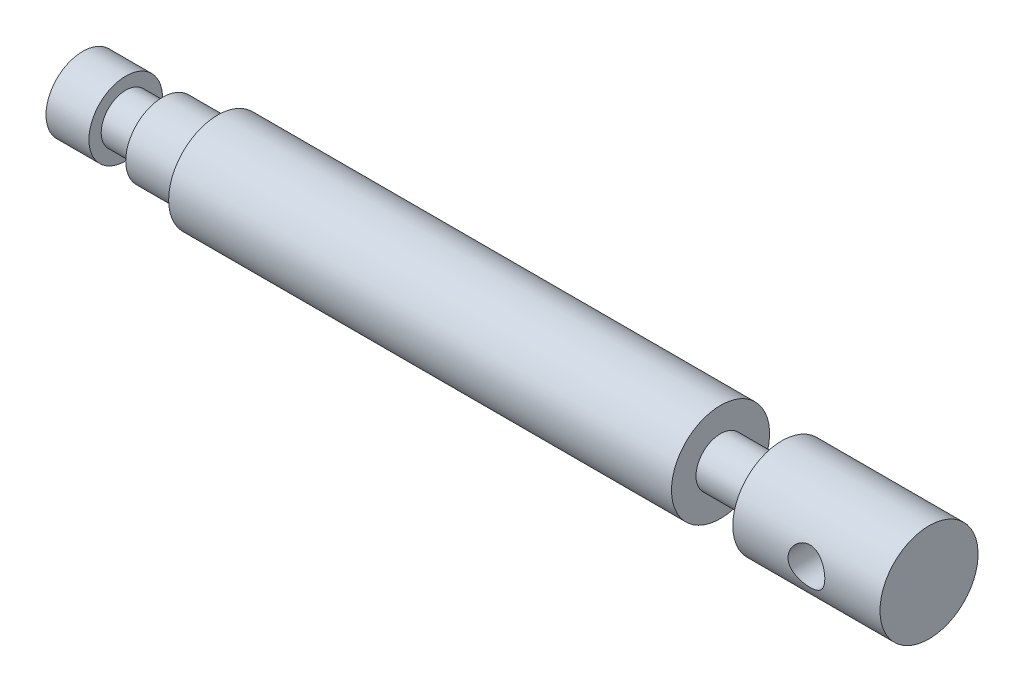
ISO-10303-21;
HEADER;
FILE_DESCRIPTION(('STEP AP214'),'2;1');
FILE_NAME('part.step','',(''),(''),'','','');
FILE_SCHEMA(('AUTOMOTIVE_DESIGN { 1 0 10303 214 1 1 1 1 }'));
ENDSEC;
DATA;
#1=APPLICATION_CONTEXT('core data for automotive mechanical design processes');
#2=APPLICATION_PROTOCOL_DEFINITION('international standard','automotive_design',2000,#1);
#3=PRODUCT_CONTEXT('',#1,'mechanical');
#4=PRODUCT('Part','Part','',(#3));
#5=PRODUCT_RELATED_PRODUCT_CATEGORY('part','',(#4));
#6=PRODUCT_DEFINITION_FORMATION('','',#4);
#7=PRODUCT_DEFINITION_CONTEXT('part definition',#1,'design');
#8=PRODUCT_DEFINITION('design','',#6,#7);
#9=PRODUCT_DEFINITION_SHAPE('','',#8);
#10=(LENGTH_UNIT() NAMED_UNIT(*) SI_UNIT(.MILLI.,.METRE.));
#11=(NAMED_UNIT(*) PLANE_ANGLE_UNIT() SI_UNIT($,.RADIAN.));
#12=(NAMED_UNIT(*) SI_UNIT($,.STERADIAN.) SOLID_ANGLE_UNIT());
#13=UNCERTAINTY_MEASURE_WITH_UNIT(LENGTH_MEASURE(1.E-05),#10,'distance_accuracy_value','');
#14=(GEOMETRIC_REPRESENTATION_CONTEXT(3) GLOBAL_UNCERTAINTY_ASSIGNED_CONTEXT((#13)) GLOBAL_UNIT_ASSIGNED_CONTEXT((#10,
#11,#12)) REPRESENTATION_CONTEXT('',''));
#15=CARTESIAN_POINT('',(0.,0.,0.));
#16=DIRECTION('',(0.,0.,1.));
#17=DIRECTION('',(1.,0.,0.));
#18=AXIS2_PLACEMENT_3D('',#15,#16,#17);
#19=CARTESIAN_POINT('',(0.,0.,0.));
#20=DIRECTION('',(1.,0.,0.));
#21=DIRECTION('',(0.,0.,-1.));
#22=AXIS2_PLACEMENT_3D('',#19,#20,#21);
#23=PLANE('',#22);
#24=CARTESIAN_POINT('',(0.,0.,0.));
#25=DIRECTION('',(-1.,0.,0.));
#26=DIRECTION('',(0.,0.,1.));
#27=AXIS2_PLACEMENT_3D('',#24,#25,#26);
#28=CIRCLE('',#27,6.);
#29=CARTESIAN_POINT('',(0.,0.,6.));
#30=VERTEX_POINT('',#29);
#31=EDGE_CURVE('E10',#30,#30,#28,.T.);
#32=ORIENTED_EDGE('',*,*,#31,.T.);
#33=EDGE_LOOP('',(#32));
#34=FACE_BOUND('',#33,.T.);
#35=ADVANCED_FACE('F29',(#34),#23,.F.);
#36=CARTESIAN_POINT('',(0.,0.,0.));
#37=DIRECTION('',(-1.,0.,0.));
#38=DIRECTION('',(0.,0.,1.));
#39=AXIS2_PLACEMENT_3D('',#36,#37,#38);
#40=CYLINDRICAL_SURFACE('',#39,6.);
#41=ORIENTED_EDGE('',*,*,#31,.F.);
#42=EDGE_LOOP('',(#41));
#43=FACE_BOUND('',#42,.T.);
#44=CARTESIAN_POINT('',(7.,0.,0.));
#45=DIRECTION('',(-1.,0.,0.));
#46=DIRECTION('',(0.,0.,1.));
#47=AXIS2_PLACEMENT_3D('',#44,#45,#46);
#48=CIRCLE('',#47,6.);
#49=CARTESIAN_POINT('',(7.,0.,6.));
#50=VERTEX_POINT('',#49);
#51=EDGE_CURVE('E40',#50,#50,#48,.T.);
#52=ORIENTED_EDGE('',*,*,#51,.T.);
#53=EDGE_LOOP('',(#52));
#54=FACE_BOUND('',#53,.T.);
#55=ADVANCED_FACE('F71',(#43,#54),#40,.T.);
#56=CARTESIAN_POINT('',(7.,6.,0.));
#57=DIRECTION('',(-1.,0.,0.));
#58=DIRECTION('',(0.,0.,1.));
#59=AXIS2_PLACEMENT_3D('',#56,#57,#58);
#60=PLANE('',#59);
#61=ORIENTED_EDGE('',*,*,#51,.F.);
#62=EDGE_LOOP('',(#61));
#63=FACE_BOUND('',#62,.T.);
#64=CARTESIAN_POINT('',(7.,0.,0.));
#65=DIRECTION('',(-1.,0.,0.));
#66=DIRECTION('',(0.,0.,1.));
#67=AXIS2_PLACEMENT_3D('',#64,#65,#66);
#68=CIRCLE('',#67,4.);
#69=CARTESIAN_POINT('',(7.,0.,4.));
#70=VERTEX_POINT('',#69);
#71=EDGE_CURVE('E45',#70,#70,#68,.T.);
#72=ORIENTED_EDGE('',*,*,#71,.T.);
#73=EDGE_LOOP('',(#72));
#74=FACE_BOUND('',#73,.T.);
#75=ADVANCED_FACE('F75',(#63,#74),#60,.F.);
#76=CARTESIAN_POINT('',(0.,0.,0.));
#77=DIRECTION('',(-1.,0.,0.));
#78=DIRECTION('',(0.,0.,1.));
#79=AXIS2_PLACEMENT_3D('',#76,#77,#78);
#80=CYLINDRICAL_SURFACE('',#79,4.);
#81=ORIENTED_EDGE('',*,*,#71,.F.);
#82=EDGE_LOOP('',(#81));
#83=FACE_BOUND('',#82,.T.);
#84=CARTESIAN_POINT('',(13.,0.,0.));
#85=DIRECTION('',(-1.,0.,0.));
#86=DIRECTION('',(0.,0.,1.));
#87=AXIS2_PLACEMENT_3D('',#84,#85,#86);
#88=CIRCLE('',#87,4.);
#89=CARTESIAN_POINT('',(13.,0.,4.));
#90=VERTEX_POINT('',#89);
#91=EDGE_CURVE('E144',#90,#90,#88,.T.);
#92=ORIENTED_EDGE('',*,*,#91,.T.);
#93=EDGE_LOOP('',(#92));
#94=FACE_BOUND('',#93,.T.);
#95=ADVANCED_FACE('F80',(#83,#94),#80,.T.);
#96=CARTESIAN_POINT('',(13.,4.,0.));
#97=DIRECTION('',(1.,0.,0.));
#98=DIRECTION('',(0.,0.,-1.));
#99=AXIS2_PLACEMENT_3D('',#96,#97,#98);
#100=PLANE('',#99);
#101=ORIENTED_EDGE('',*,*,#91,.F.);
#102=EDGE_LOOP('',(#101));
#103=FACE_BOUND('',#102,.T.);
#104=CARTESIAN_POINT('',(13.,0.,0.));
#105=DIRECTION('',(-1.,0.,0.));
#106=DIRECTION('',(0.,0.,1.));
#107=AXIS2_PLACEMENT_3D('',#104,#105,#106);
#108=CIRCLE('',#107,6.);
#109=CARTESIAN_POINT('',(13.,0.,6.));
#110=VERTEX_POINT('',#109);
#111=EDGE_CURVE('E141',#110,#110,#108,.T.);
#112=ORIENTED_EDGE('',*,*,#111,.T.);
#113=EDGE_LOOP('',(#112));
#114=FACE_BOUND('',#113,.T.);
#115=ADVANCED_FACE('F87',(#103,#114),#100,.F.);
#116=CARTESIAN_POINT('',(0.,0.,0.));
#117=DIRECTION('',(-1.,0.,0.));
#118=DIRECTION('',(0.,0.,1.));
#119=AXIS2_PLACEMENT_3D('',#116,#117,#118);
#120=CYLINDRICAL_SURFACE('',#119,6.);
#121=ORIENTED_EDGE('',*,*,#111,.F.);
#122=EDGE_LOOP('',(#121));
#123=FACE_BOUND('',#122,.T.);
#124=CARTESIAN_POINT('',(22.,0.,0.));
#125=DIRECTION('',(-1.,0.,0.));
#126=DIRECTION('',(0.,0.,1.));
#127=AXIS2_PLACEMENT_3D('',#124,#125,#126);
#128=CIRCLE('',#127,6.);
#129=CARTESIAN_POINT('',(22.,0.,6.));
#130=VERTEX_POINT('',#129);
#131=EDGE_CURVE('E138',#130,#130,#128,.T.);
#132=ORIENTED_EDGE('',*,*,#131,.T.);
#133=EDGE_LOOP('',(#132));
#134=FACE_BOUND('',#133,.T.);
#135=ADVANCED_FACE('F91',(#123,#134),#120,.T.);
#136=CARTESIAN_POINT('',(22.,6.,0.));
#137=DIRECTION('',(1.,0.,0.));
#138=DIRECTION('',(0.,0.,-1.));
#139=AXIS2_PLACEMENT_3D('',#136,#137,#138);
#140=PLANE('',#139);
#141=ORIENTED_EDGE('',*,*,#131,.F.);
#142=EDGE_LOOP('',(#141));
#143=FACE_BOUND('',#142,.T.);
#144=CARTESIAN_POINT('',(22.,0.,0.));
#145=DIRECTION('',(-1.,0.,0.));
#146=DIRECTION('',(0.,0.,1.));
#147=AXIS2_PLACEMENT_3D('',#144,#145,#146);
#148=CIRCLE('',#147,8.);
#149=CARTESIAN_POINT('',(22.,0.,8.));
#150=VERTEX_POINT('',#149);
#151=EDGE_CURVE('E135',#150,#150,#148,.T.);
#152=ORIENTED_EDGE('',*,*,#151,.T.);
#153=EDGE_LOOP('',(#152));
#154=FACE_BOUND('',#153,.T.);
#155=ADVANCED_FACE('F95',(#143,#154),#140,.F.);
#156=CARTESIAN_POINT('',(0.,0.,0.));
#157=DIRECTION('',(-1.,0.,0.));
#158=DIRECTION('',(0.,0.,1.));
#159=AXIS2_PLACEMENT_3D('',#156,#157,#158);
#160=CYLINDRICAL_SURFACE('',#159,8.);
#161=ORIENTED_EDGE('',*,*,#151,.F.);
#162=EDGE_LOOP('',(#161));
#163=FACE_BOUND('',#162,.T.);
#164=CARTESIAN_POINT('',(104.,0.,0.));
#165=DIRECTION('',(-1.,0.,0.));
#166=DIRECTION('',(0.,0.,1.));
#167=AXIS2_PLACEMENT_3D('',#164,#165,#166);
#168=CIRCLE('',#167,8.);
#169=CARTESIAN_POINT('',(104.,0.,8.));
#170=VERTEX_POINT('',#169);
#171=EDGE_CURVE('E132',#170,#170,#168,.T.);
#172=ORIENTED_EDGE('',*,*,#171,.T.);
#173=EDGE_LOOP('',(#172));
#174=FACE_BOUND('',#173,.T.);
#175=ADVANCED_FACE('F99',(#163,#174),#160,.T.);
#176=CARTESIAN_POINT('',(104.,8.,0.));
#177=DIRECTION('',(-1.,0.,0.));
#178=DIRECTION('',(0.,0.,1.));
#179=AXIS2_PLACEMENT_3D('',#176,#177,#178);
#180=PLANE('',#179);
#181=ORIENTED_EDGE('',*,*,#171,.F.);
#182=EDGE_LOOP('',(#181));
#183=FACE_BOUND('',#182,.T.);
#184=CARTESIAN_POINT('',(104.,0.,0.));
#185=DIRECTION('',(-1.,0.,0.));
#186=DIRECTION('',(0.,0.,1.));
#187=AXIS2_PLACEMENT_3D('',#184,#185,#186);
#188=CIRCLE('',#187,4.);
#189=CARTESIAN_POINT('',(104.,0.,4.));
#190=VERTEX_POINT('',#189);
#191=EDGE_CURVE('E125',#190,#190,#188,.T.);
#192=ORIENTED_EDGE('',*,*,#191,.T.);
#193=EDGE_LOOP('',(#192));
#194=FACE_BOUND('',#193,.T.);
#195=ADVANCED_FACE('F103',(#183,#194),#180,.F.);
#196=CARTESIAN_POINT('',(0.,0.,0.));
#197=DIRECTION('',(-1.,0.,0.));
#198=DIRECTION('',(0.,0.,1.));
#199=AXIS2_PLACEMENT_3D('',#196,#197,#198);
#200=CYLINDRICAL_SURFACE('',#199,4.);
#201=ORIENTED_EDGE('',*,*,#191,.F.);
#202=EDGE_LOOP('',(#201));
#203=FACE_BOUND('',#202,.T.);
#204=CARTESIAN_POINT('',(114.,0.,0.));
#205=DIRECTION('',(-1.,0.,0.));
#206=DIRECTION('',(0.,0.,1.));
#207=AXIS2_PLACEMENT_3D('',#204,#205,#206);
#208=CIRCLE('',#207,4.);
#209=CARTESIAN_POINT('',(114.,0.,4.));
#210=VERTEX_POINT('',#209);
#211=EDGE_CURVE('E118',#210,#210,#208,.T.);
#212=ORIENTED_EDGE('',*,*,#211,.T.);
#213=EDGE_LOOP('',(#212));
#214=FACE_BOUND('',#213,.T.);
#215=ADVANCED_FACE('F107',(#203,#214),#200,.T.);
#216=CARTESIAN_POINT('',(114.,4.,0.));
#217=DIRECTION('',(1.,0.,0.));
#218=DIRECTION('',(0.,0.,-1.));
#219=AXIS2_PLACEMENT_3D('',#216,#217,#218);
#220=PLANE('',#219);
#221=ORIENTED_EDGE('',*,*,#211,.F.);
#222=EDGE_LOOP('',(#221));
#223=FACE_BOUND('',#222,.T.);
#224=CARTESIAN_POINT('',(114.,0.,0.));
#225=DIRECTION('',(-1.,0.,0.));
#226=DIRECTION('',(0.,0.,1.));
#227=AXIS2_PLACEMENT_3D('',#224,#225,#226);
#228=CIRCLE('',#227,8.);
#229=CARTESIAN_POINT('',(114.,0.,8.));
#230=VERTEX_POINT('',#229);
#231=EDGE_CURVE('E121',#230,#230,#228,.T.);
#232=ORIENTED_EDGE('',*,*,#231,.T.);
#233=EDGE_LOOP('',(#232));
#234=FACE_BOUND('',#233,.T.);
#235=ADVANCED_FACE('F67',(#223,#234),#220,.F.);
#236=CARTESIAN_POINT('',(0.,0.,0.));
#237=DIRECTION('',(-1.,0.,0.));
#238=DIRECTION('',(0.,0.,1.));
#239=AXIS2_PLACEMENT_3D('',#236,#237,#238);
#240=CYLINDRICAL_SURFACE('',#239,8.);
#241=CARTESIAN_POINT('',(129.,0.,8.));
#242=CARTESIAN_POINT('',(129.000005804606,-0.162470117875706,8.00000434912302));
#243=CARTESIAN_POINT('',(128.986760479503,-0.324900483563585,7.99500758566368));
#244=CARTESIAN_POINT('',(128.93434360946,-0.644906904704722,7.97557392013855));
#245=CARTESIAN_POINT('',(128.895175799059,-0.80248365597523,7.96113837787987));
#246=CARTESIAN_POINT('',(128.792493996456,-1.10812156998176,7.92437664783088));
#247=CARTESIAN_POINT('',(128.729026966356,-1.25620044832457,7.90206568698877));
#248=CARTESIAN_POINT('',(128.579787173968,-1.53959862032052,7.85177535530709));
#249=CARTESIAN_POINT('',(128.494008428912,-1.67491447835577,7.82379446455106));
#250=CARTESIAN_POINT('',(128.298774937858,-1.93469283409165,7.76372493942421));
#251=CARTESIAN_POINT('',(128.188539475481,-2.05854146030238,7.73152005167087));
#252=CARTESIAN_POINT('',(127.949179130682,-2.28648842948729,7.66720441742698));
#253=CARTESIAN_POINT('',(127.820048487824,-2.39058072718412,7.63509370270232));
#254=CARTESIAN_POINT('',(127.540565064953,-2.57996404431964,7.5732494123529));
#255=CARTESIAN_POINT('',(127.389591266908,-2.66438786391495,7.5436529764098));
#256=CARTESIAN_POINT('',(127.074303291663,-2.80637292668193,7.49199720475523));
#257=CARTESIAN_POINT('',(126.909994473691,-2.86394489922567,7.46993485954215));
#258=CARTESIAN_POINT('',(126.579766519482,-2.94816862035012,7.4370882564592));
#259=CARTESIAN_POINT('',(126.414189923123,-2.97599186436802,7.42587848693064));
#260=CARTESIAN_POINT('',(126.080367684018,-3.00359113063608,7.41476122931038));
#261=CARTESIAN_POINT('',(125.912123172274,-3.00337873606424,7.41484907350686));
#262=CARTESIAN_POINT('',(125.588460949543,-2.97580859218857,7.42595023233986));
#263=CARTESIAN_POINT('',(125.432878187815,-2.9500761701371,7.43630937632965));
#264=CARTESIAN_POINT('',(125.128425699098,-2.87488335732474,7.46569876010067));
#265=CARTESIAN_POINT('',(124.979556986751,-2.82541939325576,7.48473030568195));
#266=CARTESIAN_POINT('',(124.689445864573,-2.70327497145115,7.52971404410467));
#267=CARTESIAN_POINT('',(124.548401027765,-2.63017297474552,7.55579035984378));
#268=CARTESIAN_POINT('',(124.28010852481,-2.46312147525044,7.61188420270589));
#269=CARTESIAN_POINT('',(124.152865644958,-2.36916477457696,7.64190308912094));
#270=CARTESIAN_POINT('',(123.906792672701,-2.15563561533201,7.70496077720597));
#271=CARTESIAN_POINT('',(123.789102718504,-2.03476597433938,7.73806694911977));
#272=CARTESIAN_POINT('',(123.575324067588,-1.77462518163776,7.80183456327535));
#273=CARTESIAN_POINT('',(123.479238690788,-1.63535120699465,7.83249562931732));
#274=CARTESIAN_POINT('',(123.310139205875,-1.33944687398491,7.88852789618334));
#275=CARTESIAN_POINT('',(123.237504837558,-1.18258142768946,7.91380996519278));
#276=CARTESIAN_POINT('',(123.12003479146,-0.857673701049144,7.95557436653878));
#277=CARTESIAN_POINT('',(123.075186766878,-0.689636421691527,7.97206060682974));
#278=CARTESIAN_POINT('',(123.016754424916,-0.356750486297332,7.99368886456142));
#279=CARTESIAN_POINT('',(123.001634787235,-0.192207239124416,7.99938738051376));
#280=CARTESIAN_POINT('',(122.9986178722,0.137144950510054,8.00051787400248));
#281=CARTESIAN_POINT('',(123.010714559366,0.301953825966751,7.99595212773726));
#282=CARTESIAN_POINT('',(123.060620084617,0.620524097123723,7.97743419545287));
#283=CARTESIAN_POINT('',(123.097423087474,0.774466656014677,7.9638494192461));
#284=CARTESIAN_POINT('',(123.194372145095,1.07388350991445,7.92902954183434));
#285=CARTESIAN_POINT('',(123.254521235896,1.21935670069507,7.9077934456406));
#286=CARTESIAN_POINT('',(123.398372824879,1.50249553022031,7.85899248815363));
#287=CARTESIAN_POINT('',(123.482715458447,1.63980616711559,7.83126000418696));
#288=CARTESIAN_POINT('',(123.671836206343,1.89878542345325,7.77253343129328));
#289=CARTESIAN_POINT('',(123.77662186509,2.0204482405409,7.74153814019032));
#290=CARTESIAN_POINT('',(124.010808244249,2.25206159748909,7.67746658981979));
#291=CARTESIAN_POINT('',(124.141284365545,2.36092308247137,7.64437393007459));
#292=CARTESIAN_POINT('',(124.419302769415,2.55542100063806,7.58157631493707));
#293=CARTESIAN_POINT('',(124.566846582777,2.64105534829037,7.55187166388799));
#294=CARTESIAN_POINT('',(124.876031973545,2.78675547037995,7.49933659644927));
#295=CARTESIAN_POINT('',(125.037729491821,2.84671370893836,7.47653520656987));
#296=CARTESIAN_POINT('',(125.370019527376,2.93815766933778,7.4410806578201));
#297=CARTESIAN_POINT('',(125.540606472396,2.9696610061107,7.42842122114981));
#298=CARTESIAN_POINT('',(125.874032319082,3.00172694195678,7.41551789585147));
#299=CARTESIAN_POINT('',(126.036665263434,3.00414662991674,7.41452889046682));
#300=CARTESIAN_POINT('',(126.359890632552,2.98273431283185,7.42316825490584));
#301=CARTESIAN_POINT('',(126.520483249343,2.95890479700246,7.43279561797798));
#302=CARTESIAN_POINT('',(126.830094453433,2.88711631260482,7.46096283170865));
#303=CARTESIAN_POINT('',(126.979316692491,2.83991596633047,7.47922170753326));
#304=CARTESIAN_POINT('',(127.267811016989,2.72339393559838,7.5224309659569));
#305=CARTESIAN_POINT('',(127.40708057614,2.65406665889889,7.54738303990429));
#306=CARTESIAN_POINT('',(127.679653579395,2.49104151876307,7.60279447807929));
#307=CARTESIAN_POINT('',(127.8122615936,2.3962566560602,7.63347396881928));
#308=CARTESIAN_POINT('',(128.060283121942,2.18668971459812,7.69612493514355));
#309=CARTESIAN_POINT('',(128.175691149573,2.07190128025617,7.7280968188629));
#310=CARTESIAN_POINT('',(128.392403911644,1.81816079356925,7.79180849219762));
#311=CARTESIAN_POINT('',(128.492607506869,1.67823728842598,7.82344209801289));
#312=CARTESIAN_POINT('',(128.668045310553,1.38242644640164,7.88109028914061));
#313=CARTESIAN_POINT('',(128.743277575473,1.22653786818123,7.90710443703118));
#314=CARTESIAN_POINT('',(128.868753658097,0.895998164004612,7.9514858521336));
#315=CARTESIAN_POINT('',(128.917774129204,0.720826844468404,7.96947314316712));
#316=CARTESIAN_POINT('',(128.983385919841,0.363751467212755,7.99372484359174));
#317=CARTESIAN_POINT('',(128.999993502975,0.181850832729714,7.99999513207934));
#318=CARTESIAN_POINT('',(129.,0.,8.));
#319=B_SPLINE_CURVE_WITH_KNOTS('',3,(#241,#242,#243,#244,#245,#246,#247,#248,#249,#250,#251,
#252,#253,#254,#255,#256,#257,#258,#259,#260,#261,#262,#263,#264,#265,#266,#267,#268,#269,#270,
#271,#272,#273,#274,#275,#276,#277,#278,#279,#280,#281,#282,#283,#284,#285,#286,#287,#288,#289,
#290,#291,#292,#293,#294,#295,#296,#297,#298,#299,#300,#301,#302,#303,#304,#305,#306,#307,#308,
#309,#310,#311,#312,#313,#314,#315,#316,#317,#318),.UNSPECIFIED.,.T.,.F.,(4,2,2,2,2,2,2,2,2,2,2,
2,2,2,2,2,2,2,2,2,2,2,2,2,2,2,2,2,2,2,2,2,2,2,2,2,2,2,4),(0.,0.48673960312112,0.973409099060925,
1.45914273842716,1.94500675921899,2.44947237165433,2.95409209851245,3.47793349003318,
4.00156538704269,4.503717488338,5.00566212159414,5.47756690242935,5.9495427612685,
6.43044816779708,6.9115198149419,7.42492306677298,7.93840515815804,8.45982750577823,
8.98101799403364,9.47450039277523,9.96787336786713,10.4422887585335,10.9167658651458,
11.4051844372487,11.8937836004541,12.4107303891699,12.9277235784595,13.4468613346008,
13.9656774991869,14.4511752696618,14.9366270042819,15.4072628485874,15.8780177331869,
16.3734494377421,16.8690388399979,17.3914465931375,17.9138949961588,18.4589703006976,
19.0037720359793),.UNSPECIFIED.);
#320=CARTESIAN_POINT('',(129.,0.,8.));
#321=VERTEX_POINT('',#320);
#322=EDGE_CURVE('E32',#321,#321,#319,.T.);
#323=ORIENTED_EDGE('',*,*,#322,.T.);
#324=EDGE_LOOP('',(#323));
#325=FACE_BOUND('',#324,.T.);
#326=CARTESIAN_POINT('',(129.,0.,-8.));
#327=CARTESIAN_POINT('',(129.000005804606,0.162470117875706,-8.00000434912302));
#328=CARTESIAN_POINT('',(128.986760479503,0.324900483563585,-7.99500758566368));
#329=CARTESIAN_POINT('',(128.93434360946,0.644906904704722,-7.97557392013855));
#330=CARTESIAN_POINT('',(128.895175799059,0.80248365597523,-7.96113837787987));
#331=CARTESIAN_POINT('',(128.792493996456,1.10812156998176,-7.92437664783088));
#332=CARTESIAN_POINT('',(128.729026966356,1.25620044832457,-7.90206568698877));
#333=CARTESIAN_POINT('',(128.579787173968,1.53959862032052,-7.85177535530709));
#334=CARTESIAN_POINT('',(128.494008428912,1.67491447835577,-7.82379446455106));
#335=CARTESIAN_POINT('',(128.298774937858,1.93469283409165,-7.76372493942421));
#336=CARTESIAN_POINT('',(128.188539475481,2.05854146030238,-7.73152005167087));
#337=CARTESIAN_POINT('',(127.949179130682,2.28648842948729,-7.66720441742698));
#338=CARTESIAN_POINT('',(127.820048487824,2.39058072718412,-7.63509370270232));
#339=CARTESIAN_POINT('',(127.540565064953,2.57996404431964,-7.5732494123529));
#340=CARTESIAN_POINT('',(127.389591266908,2.66438786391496,-7.5436529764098));
#341=CARTESIAN_POINT('',(127.074303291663,2.80637292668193,-7.49199720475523));
#342=CARTESIAN_POINT('',(126.909994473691,2.86394489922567,-7.46993485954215));
#343=CARTESIAN_POINT('',(126.579766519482,2.94816862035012,-7.4370882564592));
#344=CARTESIAN_POINT('',(126.414189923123,2.97599186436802,-7.42587848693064));
#345=CARTESIAN_POINT('',(126.080367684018,3.00359113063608,-7.41476122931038));
#346=CARTESIAN_POINT('',(125.912123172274,3.00337873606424,-7.41484907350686));
#347=CARTESIAN_POINT('',(125.588460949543,2.97580859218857,-7.42595023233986));
#348=CARTESIAN_POINT('',(125.432878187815,2.9500761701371,-7.43630937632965));
#349=CARTESIAN_POINT('',(125.128425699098,2.87488335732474,-7.46569876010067));
#350=CARTESIAN_POINT('',(124.979556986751,2.82541939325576,-7.48473030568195));
#351=CARTESIAN_POINT('',(124.689445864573,2.70327497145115,-7.52971404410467));
#352=CARTESIAN_POINT('',(124.548401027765,2.63017297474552,-7.55579035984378));
#353=CARTESIAN_POINT('',(124.28010852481,2.46312147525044,-7.61188420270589));
#354=CARTESIAN_POINT('',(124.152865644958,2.36916477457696,-7.64190308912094));
#355=CARTESIAN_POINT('',(123.906792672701,2.155635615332,-7.70496077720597));
#356=CARTESIAN_POINT('',(123.789102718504,2.03476597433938,-7.73806694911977));
#357=CARTESIAN_POINT('',(123.575324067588,1.77462518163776,-7.80183456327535));
#358=CARTESIAN_POINT('',(123.479238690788,1.63535120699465,-7.83249562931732));
#359=CARTESIAN_POINT('',(123.310139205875,1.33944687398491,-7.88852789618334));
#360=CARTESIAN_POINT('',(123.237504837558,1.18258142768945,-7.91380996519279));
#361=CARTESIAN_POINT('',(123.12003479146,0.857673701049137,-7.95557436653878));
#362=CARTESIAN_POINT('',(123.075186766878,0.68963642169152,-7.97206060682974));
#363=CARTESIAN_POINT('',(123.016754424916,0.356750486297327,-7.99368886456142));
#364=CARTESIAN_POINT('',(123.001634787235,0.192207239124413,-7.99938738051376));
#365=CARTESIAN_POINT('',(122.9986178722,-0.137144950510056,-8.00051787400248));
#366=CARTESIAN_POINT('',(123.010714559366,-0.301953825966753,-7.99595212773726));
#367=CARTESIAN_POINT('',(123.060620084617,-0.620524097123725,-7.97743419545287));
#368=CARTESIAN_POINT('',(123.097423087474,-0.774466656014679,-7.9638494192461));
#369=CARTESIAN_POINT('',(123.194372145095,-1.07388350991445,-7.92902954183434));
#370=CARTESIAN_POINT('',(123.254521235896,-1.21935670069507,-7.9077934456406));
#371=CARTESIAN_POINT('',(123.398372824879,-1.50249553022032,-7.85899248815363));
#372=CARTESIAN_POINT('',(123.482715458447,-1.6398061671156,-7.83126000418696));
#373=CARTESIAN_POINT('',(123.671836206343,-1.89878542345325,-7.77253343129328));
#374=CARTESIAN_POINT('',(123.77662186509,-2.02044824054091,-7.74153814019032));
#375=CARTESIAN_POINT('',(124.010808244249,-2.25206159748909,-7.67746658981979));
#376=CARTESIAN_POINT('',(124.141284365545,-2.36092308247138,-7.64437393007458));
#377=CARTESIAN_POINT('',(124.419302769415,-2.55542100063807,-7.58157631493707));
#378=CARTESIAN_POINT('',(124.566846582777,-2.64105534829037,-7.55187166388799));
#379=CARTESIAN_POINT('',(124.876031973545,-2.78675547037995,-7.49933659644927));
#380=CARTESIAN_POINT('',(125.037729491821,-2.84671370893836,-7.47653520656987));
#381=CARTESIAN_POINT('',(125.370019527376,-2.93815766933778,-7.4410806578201));
#382=CARTESIAN_POINT('',(125.540606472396,-2.9696610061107,-7.42842122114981));
#383=CARTESIAN_POINT('',(125.874032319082,-3.00172694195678,-7.41551789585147));
#384=CARTESIAN_POINT('',(126.036665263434,-3.00414662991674,-7.41452889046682));
#385=CARTESIAN_POINT('',(126.359890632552,-2.98273431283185,-7.42316825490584));
#386=CARTESIAN_POINT('',(126.520483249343,-2.95890479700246,-7.43279561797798));
#387=CARTESIAN_POINT('',(126.830094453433,-2.88711631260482,-7.46096283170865));
#388=CARTESIAN_POINT('',(126.979316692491,-2.83991596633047,-7.47922170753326));
#389=CARTESIAN_POINT('',(127.267811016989,-2.72339393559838,-7.5224309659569));
#390=CARTESIAN_POINT('',(127.40708057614,-2.65406665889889,-7.54738303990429));
#391=CARTESIAN_POINT('',(127.679653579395,-2.49104151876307,-7.60279447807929));
#392=CARTESIAN_POINT('',(127.8122615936,-2.39625665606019,-7.63347396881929));
#393=CARTESIAN_POINT('',(128.060283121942,-2.18668971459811,-7.69612493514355));
#394=CARTESIAN_POINT('',(128.175691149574,-2.07190128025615,-7.7280968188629));
#395=CARTESIAN_POINT('',(128.392403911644,-1.81816079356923,-7.79180849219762));
#396=CARTESIAN_POINT('',(128.492607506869,-1.67823728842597,-7.82344209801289));
#397=CARTESIAN_POINT('',(128.668045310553,-1.38242644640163,-7.88109028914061));
#398=CARTESIAN_POINT('',(128.743277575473,-1.22653786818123,-7.90710443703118));
#399=CARTESIAN_POINT('',(128.868753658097,-0.895998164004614,-7.9514858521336));
#400=CARTESIAN_POINT('',(128.917774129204,-0.720826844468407,-7.96947314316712));
#401=CARTESIAN_POINT('',(128.983385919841,-0.363751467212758,-7.99372484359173));
#402=CARTESIAN_POINT('',(128.999993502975,-0.181850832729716,-7.99999513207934));
#403=CARTESIAN_POINT('',(129.,0.,-8.));
#404=B_SPLINE_CURVE_WITH_KNOTS('',3,(#326,#327,#328,#329,#330,#331,#332,#333,#334,#335,#336,
#337,#338,#339,#340,#341,#342,#343,#344,#345,#346,#347,#348,#349,#350,#351,#352,#353,#354,#355,
#356,#357,#358,#359,#360,#361,#362,#363,#364,#365,#366,#367,#368,#369,#370,#371,#372,#373,#374,
#375,#376,#377,#378,#379,#380,#381,#382,#383,#384,#385,#386,#387,#388,#389,#390,#391,#392,#393,
#394,#395,#396,#397,#398,#399,#400,#401,#402,#403),.UNSPECIFIED.,.T.,.F.,(4,2,2,2,2,2,2,2,2,2,2,
2,2,2,2,2,2,2,2,2,2,2,2,2,2,2,2,2,2,2,2,2,2,2,2,2,2,2,4),(0.,0.48673960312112,0.973409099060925,
1.45914273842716,1.94500675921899,2.44947237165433,2.95409209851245,3.47793349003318,
4.00156538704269,4.503717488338,5.00566212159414,5.47756690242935,5.9495427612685,
6.43044816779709,6.9115198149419,7.42492306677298,7.93840515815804,8.45982750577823,
8.98101799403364,9.47450039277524,9.96787336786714,10.4422887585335,10.9167658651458,
11.4051844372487,11.8937836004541,12.4107303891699,12.9277235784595,13.4468613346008,
13.9656774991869,14.4511752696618,14.9366270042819,15.4072628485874,15.8780177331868,
16.3734494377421,16.869038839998,17.3914465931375,17.9138949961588,18.4589703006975,
19.0037720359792),.UNSPECIFIED.);
#405=CARTESIAN_POINT('',(129.,0.,-8.));
#406=VERTEX_POINT('',#405);
#407=EDGE_CURVE('E48',#406,#406,#404,.T.);
#408=ORIENTED_EDGE('',*,*,#407,.T.);
#409=EDGE_LOOP('',(#408));
#410=FACE_BOUND('',#409,.T.);
#411=ORIENTED_EDGE('',*,*,#231,.F.);
#412=EDGE_LOOP('',(#411));
#413=FACE_BOUND('',#412,.T.);
#414=CARTESIAN_POINT('',(138.,0.,0.));
#415=DIRECTION('',(-1.,0.,0.));
#416=DIRECTION('',(0.,0.,1.));
#417=AXIS2_PLACEMENT_3D('',#414,#415,#416);
#418=CIRCLE('',#417,8.);
#419=CARTESIAN_POINT('',(138.,0.,8.));
#420=VERTEX_POINT('',#419);
#421=EDGE_CURVE('E123',#420,#420,#418,.T.);
#422=ORIENTED_EDGE('',*,*,#421,.T.);
#423=EDGE_LOOP('',(#422));
#424=FACE_BOUND('',#423,.T.);
#425=ADVANCED_FACE('F52',(#325,#410,#413,#424),#240,.T.);
#426=CARTESIAN_POINT('',(138.,8.,0.));
#427=DIRECTION('',(-1.,0.,0.));
#428=DIRECTION('',(0.,0.,1.));
#429=AXIS2_PLACEMENT_3D('',#426,#427,#428);
#430=PLANE('',#429);
#431=ORIENTED_EDGE('',*,*,#421,.F.);
#432=EDGE_LOOP('',(#431));
#433=FACE_BOUND('',#432,.T.);
#434=ADVANCED_FACE('F59',(#433),#430,.F.);
#435=CARTESIAN_POINT('',(126.,0.,-15.));
#436=DIRECTION('',(0.,0.,1.));
#437=DIRECTION('',(1.,0.,0.));
#438=AXIS2_PLACEMENT_3D('',#435,#436,#437);
#439=CYLINDRICAL_SURFACE('',#438,2.99999999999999);
#440=ORIENTED_EDGE('',*,*,#407,.F.);
#441=EDGE_LOOP('',(#440));
#442=FACE_BOUND('',#441,.T.);
#443=ORIENTED_EDGE('',*,*,#322,.F.);
#444=EDGE_LOOP('',(#443));
#445=FACE_BOUND('',#444,.T.);
#446=ADVANCED_FACE('F56',(#442,#445),#439,.F.);
#447=CLOSED_SHELL('',(#35,#55,#75,#95,#115,#135,#155,#175,#195,#215,#235,#425,#434,#446));
#448=MANIFOLD_SOLID_BREP('B2',#447);
#449=ADVANCED_BREP_SHAPE_REPRESENTATION('',(#18,#448),#14);
#450=SHAPE_DEFINITION_REPRESENTATION(#9,#449);
ENDSEC;
END-ISO-10303-21;
